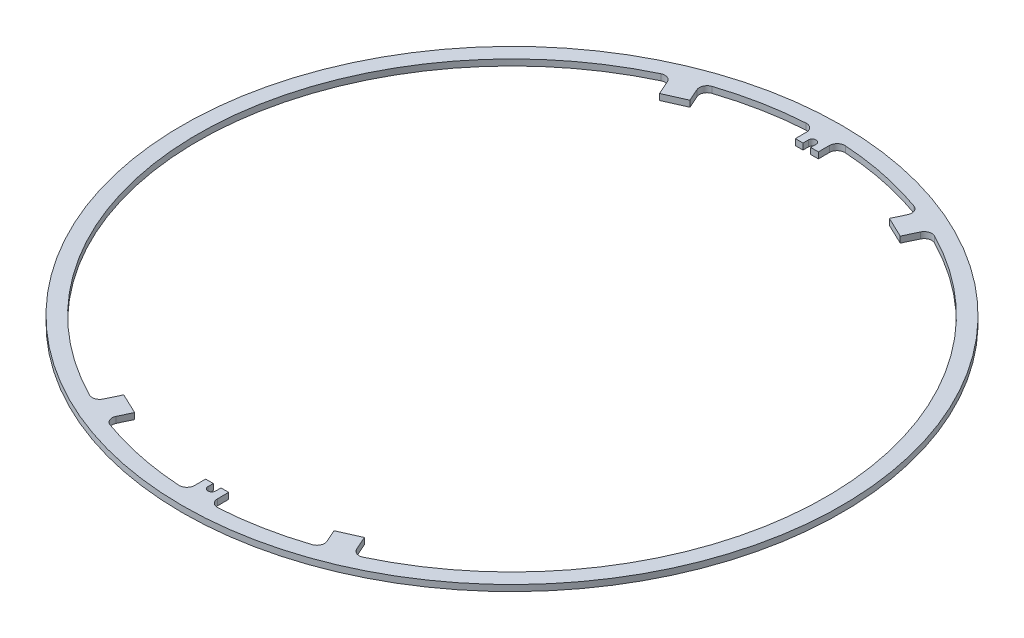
from build123d import *

# Parameters (mm, degrees)
SKETCH_1_R          = 43
SKETCH_1_R_2        = 41
EXTRUDE_1_DEPTH     = 0.8
EXTRUDE_START       = -0.8
EXTRUDE_2_DEPTH     = 0.8
FILLET_1_R          = 1
FILLET_2_R          = 1
CUT_EXTRUDE_1_DEPTH = 61.816445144
EXTRUDE_3_DEPTH     = 0.8
FILLET_3_R          = 1
EXTRUDE_4_DEPTH     = 0.8
FILLET_4_R          = 1


with BuildPart() as part:
    # Sketch 1 → Extrude 1 (new body)
    with BuildSketch(Plane(origin=(0, 0, 0), x_dir=(1, 0, 0), z_dir=(0, 1, 0))):
        with Locations(Location((0, 0, 0), (0, 0, 270))):
            Circle(SKETCH_1_R)
        with Locations(Location((0, 0, 0), (0, 0, 270))):
            Circle(SKETCH_1_R_2, mode=Mode.SUBTRACT)
    extrude(amount=EXTRUDE_1_DEPTH)

    # Sketch 2 → Extrude 2 (add)
    with BuildSketch(Plane(origin=(0, 0.8, 0), x_dir=(1, 0, 0), z_dir=(0, 1, 0)).offset(EXTRUDE_START)):
        with BuildLine():
            Line((-1.5, -38.472551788), (-1.5, -40.972551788))
            ThreePointArc((-1.5, -40.972551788), (0, -41), (1.5, -40.972551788))
            Line((1.5, -40.972551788), (1.5, -38.472551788))
            Line((1.5, -38.472551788), (-1.5, -38.472551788))
        make_face()
        with BuildLine():
            ThreePointArc((1.5, 40.972551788), (0, 41), (-1.5, 40.972551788))
            Line((-1.5, 40.972551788), (-1.5, 38.472551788))
            Line((-1.5, 38.472551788), (1.5, 38.472551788))
            Line((1.5, 38.472551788), (1.5, 40.972551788))
        make_face()
    extrude(amount=EXTRUDE_2_DEPTH)

    # Fillet 1
    fillet_1_edges = [part.edges().sort_by_distance(p)[0] for p in [
        (-1.5, 0.4, -40.972551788),
        (1.5, 0.4, -40.972551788),
    ]]
    fillet(fillet_1_edges, radius=FILLET_1_R)

    # Fillet 2
    fillet_2_edges = [part.edges().sort_by_distance(p)[0] for p in [
        (-1.5, 0.4, 40.972551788),
        (1.5, 0.4, 40.972551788),
    ]]
    fillet(fillet_2_edges, radius=FILLET_2_R)

    # Sketch 3 → Cut-Extrude 1 (cut, through all)
    with BuildSketch(Plane.XZ):
        with BuildLine():
            Line((-0.5, 39.172551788), (-0.5, 36.172551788))
            Line((-0.5, 36.172551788), (0.5, 36.172551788))
            Line((0.5, 36.172551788), (0.5, 39.172551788))
            ThreePointArc((0.5, 39.172551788), (0, 39.672551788), (-0.5, 39.172551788))
        make_face()
        with BuildLine():
            Line((0.5, -36.172551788), (0.5, -39.172551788))
            ThreePointArc((0.5, -39.172551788), (0, -39.672551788), (-0.5, -39.172551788))
            Line((-0.5, -39.172551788), (-0.5, -36.172551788))
            Line((-0.5, -36.172551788), (0.5, -36.172551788))
        make_face()
    extrude(amount=-CUT_EXTRUDE_1_DEPTH, mode=Mode.SUBTRACT)

    # Sketch 4 → Extrude 3 (add)
    with BuildSketch(Plane(origin=(0, 0.8, 0), x_dir=(1, 0, 0), z_dir=(0, 1, 0)).offset(EXTRUDE_START)):
        with BuildLine():
            Line((-17.650954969, -37.005996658), (-16.359421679, -34.298240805))
            Line((-16.359421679, -34.298240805), (-13.651665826, -35.589774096))
            Line((-13.651665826, -35.589774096), (-14.895884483, -38.198332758))
            ThreePointArc((-14.895884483, -38.198332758), (-16.284336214, -37.627388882), (-17.650954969, -37.005996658))
        make_face()
        with BuildLine():
            Line((17.650954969, 37.005996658), (16.359421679, 34.298240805))
            Line((16.359421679, 34.298240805), (13.651665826, 35.589774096))
            Line((13.651665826, 35.589774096), (14.895884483, 38.198332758))
            ThreePointArc((14.895884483, 38.198332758), (16.284336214, 37.627388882), (17.650954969, 37.005996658))
        make_face()
    extrude(amount=EXTRUDE_3_DEPTH)

    # Fillet 3
    fillet_3_edges = [part.edges().sort_by_distance(p)[0] for p in [
        (-14.895884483, 0.4, 38.198332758),
        (-17.650954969, 0.4, 37.005996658),
        (14.895884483, 0.4, -38.198332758),
        (17.650954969, 0.4, -37.005996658),
    ]]
    fillet(fillet_3_edges, radius=FILLET_3_R)

    # Sketch 5 → Extrude 4 (add)
    with BuildSketch(Plane.XZ):
        with BuildLine():
            Line((16.676202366, 37.455363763), (15.455992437, 34.71472739))
            Line((15.455992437, 34.71472739), (12.715356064, 35.93493732))
            Line((12.715356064, 35.93493732), (13.890864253, 38.575171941))
            ThreePointArc((13.890864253, 38.575171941), (15.293785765, 38.040769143), (16.676202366, 37.455363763))
        make_face()
        with BuildLine():
            Line((-12.715356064, -35.93493732), (-13.890864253, -38.575171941))
            ThreePointArc((-13.890864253, -38.575171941), (-15.293785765, -38.040769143), (-16.676202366, -37.455363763))
            Line((-16.676202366, -37.455363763), (-15.455992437, -34.71472739))
            Line((-15.455992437, -34.71472739), (-12.715356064, -35.93493732))
        make_face()
    extrude(amount=-EXTRUDE_4_DEPTH)

    # Fillet 4
    fillet_4_edges = [part.edges().sort_by_distance(p)[0] for p in [
        (16.676202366, 0.4, 37.455363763),
        (13.890864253, 0.4, 38.575171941),
        (-16.676202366, 0.4, -37.455363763),
        (-13.890864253, 0.4, -38.575171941),
    ]]
    fillet(fillet_4_edges, radius=FILLET_4_R)


solid = part.part
